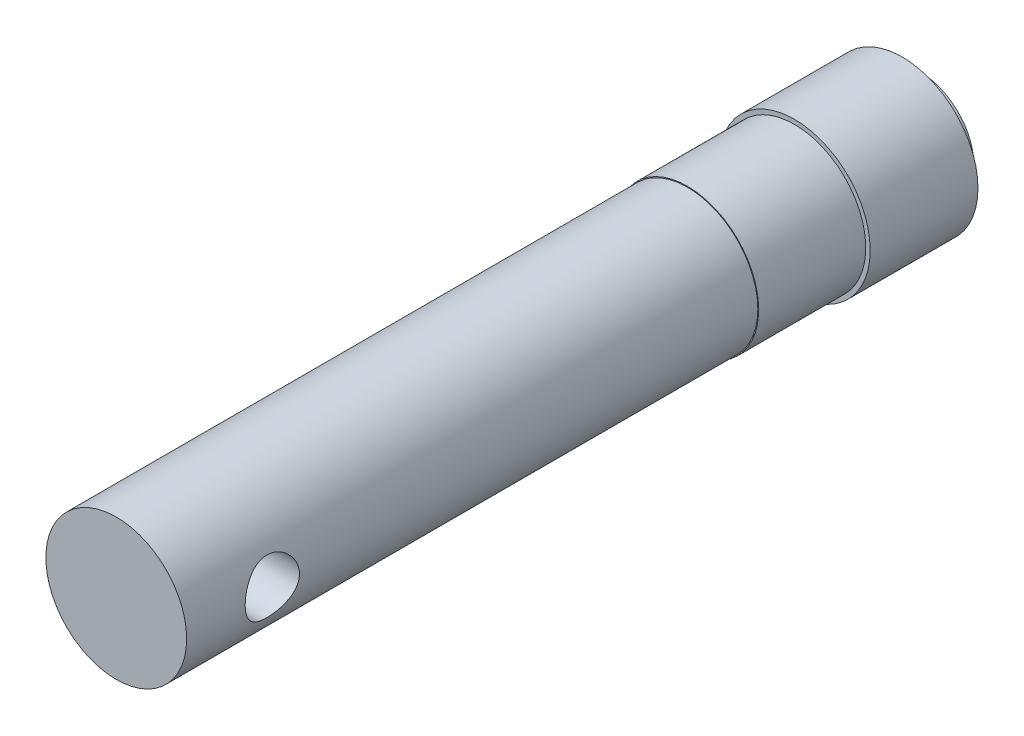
ISO-10303-21;
HEADER;
FILE_DESCRIPTION(('STEP AP214'),'2;1');
FILE_NAME('part.step','',(''),(''),'','','');
FILE_SCHEMA(('AUTOMOTIVE_DESIGN { 1 0 10303 214 1 1 1 1 }'));
ENDSEC;
DATA;
#1=APPLICATION_CONTEXT('core data for automotive mechanical design processes');
#2=APPLICATION_PROTOCOL_DEFINITION('international standard','automotive_design',2000,#1);
#3=PRODUCT_CONTEXT('',#1,'mechanical');
#4=PRODUCT('Part','Part','',(#3));
#5=PRODUCT_RELATED_PRODUCT_CATEGORY('part','',(#4));
#6=PRODUCT_DEFINITION_FORMATION('','',#4);
#7=PRODUCT_DEFINITION_CONTEXT('part definition',#1,'design');
#8=PRODUCT_DEFINITION('design','',#6,#7);
#9=PRODUCT_DEFINITION_SHAPE('','',#8);
#10=(LENGTH_UNIT() NAMED_UNIT(*) SI_UNIT(.MILLI.,.METRE.));
#11=(NAMED_UNIT(*) PLANE_ANGLE_UNIT() SI_UNIT($,.RADIAN.));
#12=(NAMED_UNIT(*) SI_UNIT($,.STERADIAN.) SOLID_ANGLE_UNIT());
#13=UNCERTAINTY_MEASURE_WITH_UNIT(LENGTH_MEASURE(1.E-05),#10,'distance_accuracy_value','');
#14=(GEOMETRIC_REPRESENTATION_CONTEXT(3) GLOBAL_UNCERTAINTY_ASSIGNED_CONTEXT((#13)) GLOBAL_UNIT_ASSIGNED_CONTEXT((#10,
#11,#12)) REPRESENTATION_CONTEXT('',''));
#15=CARTESIAN_POINT('',(0.,0.,0.));
#16=DIRECTION('',(0.,0.,1.));
#17=DIRECTION('',(1.,0.,0.));
#18=AXIS2_PLACEMENT_3D('',#15,#16,#17);
#19=CARTESIAN_POINT('',(0.,0.,28.6385));
#20=DIRECTION('',(0.,0.,1.));
#21=DIRECTION('',(1.,0.,0.));
#22=AXIS2_PLACEMENT_3D('',#19,#20,#21);
#23=PLANE('',#22);
#24=CARTESIAN_POINT('',(0.,0.,28.6385));
#25=DIRECTION('',(0.,0.,1.));
#26=DIRECTION('',(1.,0.,0.));
#27=AXIS2_PLACEMENT_3D('',#24,#25,#26);
#28=CIRCLE('',#27,12.6746);
#29=CARTESIAN_POINT('',(-12.6746,0.,28.6385));
#30=VERTEX_POINT('',#29);
#31=EDGE_CURVE('E108',#30,#30,#28,.T.);
#32=ORIENTED_EDGE('',*,*,#31,.T.);
#33=EDGE_LOOP('',(#32));
#34=FACE_BOUND('',#33,.T.);
#35=CARTESIAN_POINT('',(0.,0.,28.6385));
#36=DIRECTION('',(0.,0.,1.));
#37=DIRECTION('',(1.,0.,0.));
#38=AXIS2_PLACEMENT_3D('',#35,#36,#37);
#39=CIRCLE('',#38,12.5222);
#40=CARTESIAN_POINT('',(12.5222,0.,28.6385));
#41=VERTEX_POINT('',#40);
#42=EDGE_CURVE('E117',#41,#41,#39,.T.);
#43=ORIENTED_EDGE('',*,*,#42,.F.);
#44=EDGE_LOOP('',(#43));
#45=FACE_BOUND('',#44,.T.);
#46=ADVANCED_FACE('F32',(#34,#45),#23,.T.);
#47=CARTESIAN_POINT('',(0.,0.,9.5885));
#48=DIRECTION('',(0.,0.,1.));
#49=DIRECTION('',(1.,0.,0.));
#50=AXIS2_PLACEMENT_3D('',#47,#48,#49);
#51=PLANE('',#50);
#52=CARTESIAN_POINT('',(0.,0.,9.5885));
#53=DIRECTION('',(0.,0.,1.));
#54=DIRECTION('',(1.,0.,0.));
#55=AXIS2_PLACEMENT_3D('',#52,#53,#54);
#56=CIRCLE('',#55,13.462);
#57=CARTESIAN_POINT('',(13.462,0.,9.5885));
#58=VERTEX_POINT('',#57);
#59=EDGE_CURVE('E44',#58,#58,#56,.T.);
#60=ORIENTED_EDGE('',*,*,#59,.T.);
#61=EDGE_LOOP('',(#60));
#62=FACE_BOUND('',#61,.T.);
#63=CARTESIAN_POINT('',(0.,0.,9.5885));
#64=DIRECTION('',(0.,0.,1.));
#65=DIRECTION('',(1.,0.,0.));
#66=AXIS2_PLACEMENT_3D('',#63,#64,#65);
#67=CIRCLE('',#66,12.6746);
#68=CARTESIAN_POINT('',(-12.6746,0.,9.5885));
#69=VERTEX_POINT('',#68);
#70=EDGE_CURVE('E112',#69,#69,#67,.T.);
#71=ORIENTED_EDGE('',*,*,#70,.F.);
#72=EDGE_LOOP('',(#71));
#73=FACE_BOUND('',#72,.T.);
#74=ADVANCED_FACE('F75',(#62,#73),#51,.T.);
#75=CARTESIAN_POINT('',(0.,0.,-9.5885));
#76=DIRECTION('',(0.,0.,1.));
#77=DIRECTION('',(1.,0.,0.));
#78=AXIS2_PLACEMENT_3D('',#75,#76,#77);
#79=PLANE('',#78);
#80=CARTESIAN_POINT('',(0.,0.,-9.5885));
#81=DIRECTION('',(0.,0.,1.));
#82=DIRECTION('',(1.,0.,0.));
#83=AXIS2_PLACEMENT_3D('',#80,#81,#82);
#84=CIRCLE('',#83,13.462);
#85=CARTESIAN_POINT('',(13.462,0.,-9.5885));
#86=VERTEX_POINT('',#85);
#87=EDGE_CURVE('E49',#86,#86,#84,.T.);
#88=ORIENTED_EDGE('',*,*,#87,.F.);
#89=EDGE_LOOP('',(#88));
#90=FACE_BOUND('',#89,.T.);
#91=CARTESIAN_POINT('',(0.,0.,-9.5885));
#92=DIRECTION('',(0.,0.,1.));
#93=DIRECTION('',(1.,0.,0.));
#94=AXIS2_PLACEMENT_3D('',#91,#92,#93);
#95=CIRCLE('',#94,9.5631);
#96=CARTESIAN_POINT('',(9.5631,0.,-9.5885));
#97=VERTEX_POINT('',#96);
#98=EDGE_CURVE('E10',#97,#97,#95,.F.);
#99=ORIENTED_EDGE('',*,*,#98,.F.);
#100=EDGE_LOOP('',(#99));
#101=FACE_BOUND('',#100,.T.);
#102=ADVANCED_FACE('F80',(#90,#101),#79,.F.);
#103=CARTESIAN_POINT('',(0.,0.,9.5885));
#104=DIRECTION('',(0.,0.,-1.));
#105=DIRECTION('',(-1.,0.,0.));
#106=AXIS2_PLACEMENT_3D('',#103,#104,#105);
#107=CYLINDRICAL_SURFACE('',#106,13.462);
#108=ORIENTED_EDGE('',*,*,#59,.F.);
#109=EDGE_LOOP('',(#108));
#110=FACE_BOUND('',#109,.T.);
#111=ORIENTED_EDGE('',*,*,#87,.T.);
#112=EDGE_LOOP('',(#111));
#113=FACE_BOUND('',#112,.T.);
#114=ADVANCED_FACE('F34',(#110,#113),#107,.T.);
#115=CARTESIAN_POINT('',(0.,0.,-12.7635));
#116=DIRECTION('',(0.,0.,1.));
#117=DIRECTION('',(1.,0.,0.));
#118=AXIS2_PLACEMENT_3D('',#115,#116,#117);
#119=CYLINDRICAL_SURFACE('',#118,9.5631);
#120=CARTESIAN_POINT('',(0.,0.,-12.7635));
#121=DIRECTION('',(0.,0.,-1.));
#122=DIRECTION('',(-1.,0.,0.));
#123=AXIS2_PLACEMENT_3D('',#120,#121,#122);
#124=CIRCLE('',#123,9.5631);
#125=CARTESIAN_POINT('',(-9.5631,0.,-12.7635));
#126=VERTEX_POINT('',#125);
#127=EDGE_CURVE('E106',#126,#126,#124,.T.);
#128=ORIENTED_EDGE('',*,*,#127,.F.);
#129=EDGE_LOOP('',(#128));
#130=FACE_BOUND('',#129,.T.);
#131=ORIENTED_EDGE('',*,*,#98,.T.);
#132=EDGE_LOOP('',(#131));
#133=FACE_BOUND('',#132,.T.);
#134=ADVANCED_FACE('F91',(#130,#133),#119,.T.);
#135=CARTESIAN_POINT('',(0.,0.,-12.7635));
#136=DIRECTION('',(0.,0.,-1.));
#137=DIRECTION('',(-1.,0.,0.));
#138=AXIS2_PLACEMENT_3D('',#135,#136,#137);
#139=PLANE('',#138);
#140=ORIENTED_EDGE('',*,*,#127,.T.);
#141=EDGE_LOOP('',(#140));
#142=FACE_BOUND('',#141,.T.);
#143=ADVANCED_FACE('F87',(#142),#139,.T.);
#144=CARTESIAN_POINT('',(0.,0.,28.6385));
#145=DIRECTION('',(0.,0.,-1.));
#146=DIRECTION('',(-1.,0.,0.));
#147=AXIS2_PLACEMENT_3D('',#144,#145,#146);
#148=CYLINDRICAL_SURFACE('',#147,12.6746);
#149=CARTESIAN_POINT('',(-12.6746,0.,28.6385));
#150=CARTESIAN_POINT('',(-12.6746,0.,28.4400625));
#151=CARTESIAN_POINT('',(-12.6746,0.,28.241625));
#152=CARTESIAN_POINT('',(-12.6746,0.,27.84475));
#153=CARTESIAN_POINT('',(-12.6746,0.,27.6463125));
#154=CARTESIAN_POINT('',(-12.6746,0.,27.2494375));
#155=CARTESIAN_POINT('',(-12.6746,0.,27.051));
#156=CARTESIAN_POINT('',(-12.6746,0.,26.654125));
#157=CARTESIAN_POINT('',(-12.6746,0.,26.4556875));
#158=CARTESIAN_POINT('',(-12.6746,0.,26.0588125));
#159=CARTESIAN_POINT('',(-12.6746,0.,25.860375));
#160=CARTESIAN_POINT('',(-12.6746,0.,25.4635));
#161=CARTESIAN_POINT('',(-12.6746,0.,25.2650625));
#162=CARTESIAN_POINT('',(-12.6746,0.,24.8681875));
#163=CARTESIAN_POINT('',(-12.6746,0.,24.66975));
#164=CARTESIAN_POINT('',(-12.6746,0.,24.272875));
#165=CARTESIAN_POINT('',(-12.6746,0.,24.0744375));
#166=CARTESIAN_POINT('',(-12.6746,0.,23.6775625));
#167=CARTESIAN_POINT('',(-12.6746,0.,23.479125));
#168=CARTESIAN_POINT('',(-12.6746,0.,23.08225));
#169=CARTESIAN_POINT('',(-12.6746,0.,22.8838125));
#170=CARTESIAN_POINT('',(-12.6746,0.,22.4869375));
#171=CARTESIAN_POINT('',(-12.6746,0.,22.2885));
#172=CARTESIAN_POINT('',(-12.6746,0.,21.891625));
#173=CARTESIAN_POINT('',(-12.6746,0.,21.6931875));
#174=CARTESIAN_POINT('',(-12.6746,0.,21.2963125));
#175=CARTESIAN_POINT('',(-12.6746,0.,21.097875));
#176=CARTESIAN_POINT('',(-12.6746,0.,20.701));
#177=CARTESIAN_POINT('',(-12.6746,0.,20.5025625));
#178=CARTESIAN_POINT('',(-12.6746,0.,20.1056875));
#179=CARTESIAN_POINT('',(-12.6746,0.,19.90725));
#180=CARTESIAN_POINT('',(-12.6746,0.,19.510375));
#181=CARTESIAN_POINT('',(-12.6746,0.,19.3119375));
#182=CARTESIAN_POINT('',(-12.6746,0.,18.9150625));
#183=CARTESIAN_POINT('',(-12.6746,0.,18.716625));
#184=CARTESIAN_POINT('',(-12.6746,0.,18.31975));
#185=CARTESIAN_POINT('',(-12.6746,0.,18.1213125));
#186=CARTESIAN_POINT('',(-12.6746,0.,17.7244375));
#187=CARTESIAN_POINT('',(-12.6746,0.,17.526));
#188=CARTESIAN_POINT('',(-12.6746,0.,17.129125));
#189=CARTESIAN_POINT('',(-12.6746,0.,16.9306875));
#190=CARTESIAN_POINT('',(-12.6746,0.,16.5338125));
#191=CARTESIAN_POINT('',(-12.6746,0.,16.335375));
#192=CARTESIAN_POINT('',(-12.6746,0.,15.9385));
#193=CARTESIAN_POINT('',(-12.6746,0.,15.7400625));
#194=CARTESIAN_POINT('',(-12.6746,0.,15.3431875));
#195=CARTESIAN_POINT('',(-12.6746,0.,15.14475));
#196=CARTESIAN_POINT('',(-12.6746,0.,14.747875));
#197=CARTESIAN_POINT('',(-12.6746,0.,14.5494375));
#198=CARTESIAN_POINT('',(-12.6746,0.,14.1525625));
#199=CARTESIAN_POINT('',(-12.6746,0.,13.954125));
#200=CARTESIAN_POINT('',(-12.6746,0.,13.55725));
#201=CARTESIAN_POINT('',(-12.6746,0.,13.3588125));
#202=CARTESIAN_POINT('',(-12.6746,0.,12.9619375));
#203=CARTESIAN_POINT('',(-12.6746,0.,12.7635));
#204=CARTESIAN_POINT('',(-12.6746,0.,12.366625));
#205=CARTESIAN_POINT('',(-12.6746,0.,12.1681875));
#206=CARTESIAN_POINT('',(-12.6746,0.,11.7713125));
#207=CARTESIAN_POINT('',(-12.6746,0.,11.572875));
#208=CARTESIAN_POINT('',(-12.6746,0.,11.176));
#209=CARTESIAN_POINT('',(-12.6746,0.,10.9775625));
#210=CARTESIAN_POINT('',(-12.6746,0.,10.5806875));
#211=CARTESIAN_POINT('',(-12.6746,0.,10.38225));
#212=CARTESIAN_POINT('',(-12.6746,0.,9.985375));
#213=CARTESIAN_POINT('',(-12.6746,0.,9.7869375));
#214=CARTESIAN_POINT('',(-12.6746,0.,9.5885));
#215=B_SPLINE_CURVE_WITH_KNOTS('',3,(#149,#150,#151,#152,#153,#154,#155,#156,#157,#158,#159,
#160,#161,#162,#163,#164,#165,#166,#167,#168,#169,#170,#171,#172,#173,#174,#175,#176,#177,#178,
#179,#180,#181,#182,#183,#184,#185,#186,#187,#188,#189,#190,#191,#192,#193,#194,#195,#196,#197,
#198,#199,#200,#201,#202,#203,#204,#205,#206,#207,#208,#209,#210,#211,#212,#213,#214),
.UNSPECIFIED.,.F.,.F.,(4,2,2,2,2,2,2,2,2,2,2,2,2,2,2,2,2,2,2,2,2,2,2,2,2,2,2,2,2,2,2,2,4),(0.,
0.5953125,1.190625,1.7859375,2.38125,2.9765625,3.571875,4.1671875,4.7625,5.3578125,5.953125,
6.5484375,7.14375,7.7390625,8.334375,8.9296875,9.525,10.1203125,10.715625,11.3109375,11.90625,
12.5015625,13.096875,13.6921875,14.2875,14.8828125,15.478125,16.0734375,16.66875,17.2640625,
17.859375,18.4546875,19.05),.UNSPECIFIED.);
#216=EDGE_CURVE('BSEAM71',#30,#69,#215,.T.);
#217=ORIENTED_EDGE('',*,*,#31,.F.);
#218=ORIENTED_EDGE('',*,*,#70,.T.);
#219=ORIENTED_EDGE('',*,*,#216,.T.);
#220=ORIENTED_EDGE('',*,*,#216,.F.);
#221=EDGE_LOOP('',(#217,#219,#218,#220));
#222=FACE_BOUND('',#221,.T.);
#223=ADVANCED_FACE('F71',(#222),#148,.T.);
#224=CARTESIAN_POINT('',(0.,0.,130.2385));
#225=DIRECTION('',(0.,0.,-1.));
#226=DIRECTION('',(-1.,0.,0.));
#227=AXIS2_PLACEMENT_3D('',#224,#225,#226);
#228=CYLINDRICAL_SURFACE('',#227,12.5222);
#229=CARTESIAN_POINT('',(-12.5222,0.,119.8245));
#230=CARTESIAN_POINT('',(-12.5222005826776,-0.130385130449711,119.82450077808));
#231=CARTESIAN_POINT('',(-12.5201592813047,-0.260759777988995,119.819212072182));
#232=CARTESIAN_POINT('',(-12.5120497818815,-0.520572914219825,119.798111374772));
#233=CARTESIAN_POINT('',(-12.5059803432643,-0.650011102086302,119.782296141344));
#234=CARTESIAN_POINT('',(-12.4899810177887,-0.906872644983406,119.740312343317));
#235=CARTESIAN_POINT('',(-12.4800534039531,-1.03429714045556,119.714149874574));
#236=CARTESIAN_POINT('',(-12.456597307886,-1.28635419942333,119.651717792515));
#237=CARTESIAN_POINT('',(-12.4430674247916,-1.41098565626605,119.615444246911));
#238=CARTESIAN_POINT('',(-12.4127946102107,-1.65627598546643,119.533222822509));
#239=CARTESIAN_POINT('',(-12.396059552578,-1.77694376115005,119.487298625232));
#240=CARTESIAN_POINT('',(-12.3597808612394,-2.01387894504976,119.386117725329));
#241=CARTESIAN_POINT('',(-12.3402361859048,-2.13014470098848,119.330857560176));
#242=CARTESIAN_POINT('',(-12.2780980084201,-2.471241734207,119.151700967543));
#243=CARTESIAN_POINT('',(-12.2319764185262,-2.68855784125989,119.014365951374));
#244=CARTESIAN_POINT('',(-12.1328338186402,-3.10610150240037,118.70164586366));
#245=CARTESIAN_POINT('',(-12.0796103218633,-3.30529453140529,118.524955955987));
#246=CARTESIAN_POINT('',(-11.9731865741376,-3.67216437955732,118.141089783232));
#247=CARTESIAN_POINT('',(-11.9199863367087,-3.83983074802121,117.933903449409));
#248=CARTESIAN_POINT('',(-11.8434902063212,-4.06743386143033,117.599557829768));
#249=CARTESIAN_POINT('',(-11.818077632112,-4.1405005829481,117.481609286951));
#250=CARTESIAN_POINT('',(-11.7695913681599,-4.27637784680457,117.239505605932));
#251=CARTESIAN_POINT('',(-11.7465167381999,-4.33919251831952,117.115352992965));
#252=CARTESIAN_POINT('',(-11.7034537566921,-4.45403528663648,116.861628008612));
#253=CARTESIAN_POINT('',(-11.6834657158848,-4.50606229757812,116.732055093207));
#254=CARTESIAN_POINT('',(-11.6472743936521,-4.59880108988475,116.468469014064));
#255=CARTESIAN_POINT('',(-11.6310692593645,-4.63951841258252,116.334458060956));
#256=CARTESIAN_POINT('',(-11.6036156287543,-4.70774813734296,116.068731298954));
#257=CARTESIAN_POINT('',(-11.5921860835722,-4.73574728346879,115.937159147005));
#258=CARTESIAN_POINT('',(-11.5737277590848,-4.78068099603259,115.671888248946));
#259=CARTESIAN_POINT('',(-11.5666970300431,-4.79762046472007,115.538190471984));
#260=CARTESIAN_POINT('',(-11.5572823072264,-4.82025617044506,115.269705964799));
#261=CARTESIAN_POINT('',(-11.5548975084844,-4.82595435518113,115.134919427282));
#262=CARTESIAN_POINT('',(-11.5548596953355,-4.82604509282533,114.865344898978));
#263=CARTESIAN_POINT('',(-11.5572064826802,-4.8204381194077,114.730556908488));
#264=CARTESIAN_POINT('',(-11.5662451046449,-4.79870733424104,114.470692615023));
#265=CARTESIAN_POINT('',(-11.5726489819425,-4.78328019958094,114.345547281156));
#266=CARTESIAN_POINT('',(-11.5893243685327,-4.74273480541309,114.097058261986));
#267=CARTESIAN_POINT('',(-11.5995971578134,-4.71761333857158,113.973715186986));
#268=CARTESIAN_POINT('',(-11.6236949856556,-4.6579225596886,113.729721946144));
#269=CARTESIAN_POINT('',(-11.6375191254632,-4.62335563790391,113.609071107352));
#270=CARTESIAN_POINT('',(-11.6683109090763,-4.54508249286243,113.371168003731));
#271=CARTESIAN_POINT('',(-11.6852797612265,-4.50137275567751,113.253917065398));
#272=CARTESIAN_POINT('',(-11.7409096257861,-4.35518008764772,112.903910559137));
#273=CARTESIAN_POINT('',(-11.7838169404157,-4.23875508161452,112.677471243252));
#274=CARTESIAN_POINT('',(-11.8761636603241,-3.97265705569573,112.246677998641));
#275=CARTESIAN_POINT('',(-11.9256054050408,-3.82297211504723,112.042332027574));
#276=CARTESIAN_POINT('',(-12.0297610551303,-3.48199409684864,111.646032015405));
#277=CARTESIAN_POINT('',(-12.0845995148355,-3.28849526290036,111.456000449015));
#278=CARTESIAN_POINT('',(-12.1903491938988,-2.87176743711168,111.110503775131));
#279=CARTESIAN_POINT('',(-12.241259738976,-2.64853335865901,110.955044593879));
#280=CARTESIAN_POINT('',(-12.3345343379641,-2.17353370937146,110.680807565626));
#281=CARTESIAN_POINT('',(-12.3767368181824,-1.92134442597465,110.562704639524));
#282=CARTESIAN_POINT('',(-12.4466323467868,-1.39864274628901,110.371250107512));
#283=CARTESIAN_POINT('',(-12.4743322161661,-1.12813903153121,110.297877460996));
#284=CARTESIAN_POINT('',(-12.5108844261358,-0.592661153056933,110.201744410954));
#285=CARTESIAN_POINT('',(-12.5207000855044,-0.328217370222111,110.176394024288));
#286=CARTESIAN_POINT('',(-12.5233783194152,0.201299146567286,110.169440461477));
#287=CARTESIAN_POINT('',(-12.5162449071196,0.466371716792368,110.187826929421));
#288=CARTESIAN_POINT('',(-12.4864604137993,0.978206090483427,110.265881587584));
#289=CARTESIAN_POINT('',(-12.4644583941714,1.22527286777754,110.323824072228));
#290=CARTESIAN_POINT('',(-12.4078095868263,1.70598230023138,110.477043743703));
#291=CARTESIAN_POINT('',(-12.3731611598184,1.93962321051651,110.57232577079));
#292=CARTESIAN_POINT('',(-12.2933271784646,2.39470181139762,110.800592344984));
#293=CARTESIAN_POINT('',(-12.2478571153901,2.61556443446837,110.934620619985));
#294=CARTESIAN_POINT('',(-12.1513681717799,3.03242430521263,111.235417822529));
#295=CARTESIAN_POINT('',(-12.1003471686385,3.22841197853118,111.402199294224));
#296=CARTESIAN_POINT('',(-11.9944739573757,3.6025252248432,111.775735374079));
#297=CARTESIAN_POINT('',(-11.9395786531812,3.778818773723,111.984313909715));
#298=CARTESIAN_POINT('',(-11.8350957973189,4.09435251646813,112.429293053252));
#299=CARTESIAN_POINT('',(-11.7855088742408,4.23358832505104,112.665696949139));
#300=CARTESIAN_POINT('',(-11.7194948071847,4.41168463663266,113.037268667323));
#301=CARTESIAN_POINT('',(-11.6988237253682,4.46606731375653,113.16445606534));
#302=CARTESIAN_POINT('',(-11.6610264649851,4.56384799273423,113.423477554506));
#303=CARTESIAN_POINT('',(-11.6438987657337,4.60725070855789,113.555309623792));
#304=CARTESIAN_POINT('',(-11.6137971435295,4.6826121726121,113.822615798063));
#305=CARTESIAN_POINT('',(-11.6008218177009,4.71457478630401,113.958088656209));
#306=CARTESIAN_POINT('',(-11.5794950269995,4.76671638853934,114.231642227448));
#307=CARTESIAN_POINT('',(-11.5711432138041,4.7868962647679,114.369722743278));
#308=CARTESIAN_POINT('',(-11.5597800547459,4.81426833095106,114.637918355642));
#309=CARTESIAN_POINT('',(-11.5564455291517,4.82224707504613,114.767940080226));
#310=CARTESIAN_POINT('',(-11.5541835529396,4.82766457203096,115.028288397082));
#311=CARTESIAN_POINT('',(-11.5552575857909,4.82509977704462,115.158615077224));
#312=CARTESIAN_POINT('',(-11.5617784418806,4.8094534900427,115.418460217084));
#313=CARTESIAN_POINT('',(-11.5672231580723,4.79637706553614,115.547979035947));
#314=CARTESIAN_POINT('',(-11.5823012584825,4.75985078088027,115.805344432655));
#315=CARTESIAN_POINT('',(-11.5919362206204,4.73639701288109,115.93319036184));
#316=CARTESIAN_POINT('',(-11.6146800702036,4.68033983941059,116.18187276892));
#317=CARTESIAN_POINT('',(-11.6276575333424,4.64808028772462,116.302798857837));
#318=CARTESIAN_POINT('',(-11.65683655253,4.5744088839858,116.541444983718));
#319=CARTESIAN_POINT('',(-11.6730392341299,4.53299383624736,116.659163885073));
#320=CARTESIAN_POINT('',(-11.7258138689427,4.39550568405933,117.006401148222));
#321=CARTESIAN_POINT('',(-11.7665702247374,4.28614788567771,117.230183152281));
#322=CARTESIAN_POINT('',(-11.8573680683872,4.02839105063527,117.668830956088));
#323=CARTESIAN_POINT('',(-11.9077944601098,3.87818953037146,117.882546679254));
#324=CARTESIAN_POINT('',(-12.0110271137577,3.54555250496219,118.282853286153));
#325=CARTESIAN_POINT('',(-12.0638341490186,3.36310646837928,118.469435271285));
#326=CARTESIAN_POINT('',(-12.1423424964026,3.06277900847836,118.730618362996));
#327=CARTESIAN_POINT('',(-12.1691137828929,2.95487657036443,118.816621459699));
#328=CARTESIAN_POINT('',(-12.2211069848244,2.73187138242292,118.979224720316));
#329=CARTESIAN_POINT('',(-12.2463294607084,2.61677126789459,119.055828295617));
#330=CARTESIAN_POINT('',(-12.2945391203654,2.38000175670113,119.199099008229));
#331=CARTESIAN_POINT('',(-12.3175248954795,2.25832829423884,119.265759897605));
#332=CARTESIAN_POINT('',(-12.3605850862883,2.00932435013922,119.388505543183));
#333=CARTESIAN_POINT('',(-12.380660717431,1.88199625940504,119.444594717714));
#334=CARTESIAN_POINT('',(-12.4185730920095,1.61372277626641,119.549134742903));
#335=CARTESIAN_POINT('',(-12.4361658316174,1.47243938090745,119.596810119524));
#336=CARTESIAN_POINT('',(-12.4667745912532,1.18566702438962,119.678959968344));
#337=CARTESIAN_POINT('',(-12.4797926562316,1.04017997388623,119.71344033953));
#338=CARTESIAN_POINT('',(-12.5008081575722,0.746312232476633,119.76878762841));
#339=CARTESIAN_POINT('',(-12.5088067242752,0.59793220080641,119.789657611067));
#340=CARTESIAN_POINT('',(-12.5195019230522,0.299696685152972,119.817512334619));
#341=CARTESIAN_POINT('',(-12.5221993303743,0.149841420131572,119.824499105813));
#342=CARTESIAN_POINT('',(-12.5222,0.,119.8245));
#343=B_SPLINE_CURVE_WITH_KNOTS('',3,(#229,#230,#231,#232,#233,#234,#235,#236,#237,#238,#239,
#240,#241,#242,#243,#244,#245,#246,#247,#248,#249,#250,#251,#252,#253,#254,#255,#256,#257,#258,
#259,#260,#261,#262,#263,#264,#265,#266,#267,#268,#269,#270,#271,#272,#273,#274,#275,#276,#277,
#278,#279,#280,#281,#282,#283,#284,#285,#286,#287,#288,#289,#290,#291,#292,#293,#294,#295,#296,
#297,#298,#299,#300,#301,#302,#303,#304,#305,#306,#307,#308,#309,#310,#311,#312,#313,#314,#315,
#316,#317,#318,#319,#320,#321,#322,#323,#324,#325,#326,#327,#328,#329,#330,#331,#332,#333,#334,
#335,#336,#337,#338,#339,#340,#341,#342),.UNSPECIFIED.,.T.,.F.,(4,2,2,2,2,2,2,2,2,2,2,2,2,2,2,2,
2,2,2,2,2,2,2,2,2,2,2,2,2,2,2,2,2,2,2,2,2,2,2,2,2,2,2,2,2,2,2,2,2,2,2,2,2,2,2,2,4),(0.,
0.391014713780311,0.782149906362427,1.17305501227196,1.56411235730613,1.95422107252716,
2.34447479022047,3.12439881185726,3.93559389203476,4.74705740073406,5.16978427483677,
5.59234046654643,6.01493917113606,6.43733045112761,6.84180994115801,7.24611002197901,
7.65034004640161,8.05455313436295,8.43287380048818,8.8113197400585,9.18966999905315,
9.56816594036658,10.3391815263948,11.1104739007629,11.936761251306,12.7631901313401,
13.6037944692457,14.444003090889,15.2374414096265,16.0306918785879,16.7913774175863,
17.5521615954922,18.3357313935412,19.1196018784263,19.9515351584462,20.7835668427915,
21.2026963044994,21.6216455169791,22.0404530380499,22.4592290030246,22.8496628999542,
23.2402281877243,23.6306053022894,24.0211295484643,24.3981707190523,24.7753437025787,
25.5291303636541,26.3239860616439,27.1191018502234,27.540349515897,27.9614438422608,
28.3828016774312,28.8039830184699,29.2537138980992,29.7032434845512,30.1526718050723,
30.6020343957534),.UNSPECIFIED.);
#344=CARTESIAN_POINT('',(-12.5222,0.,119.8245));
#345=VERTEX_POINT('',#344);
#346=EDGE_CURVE('E36',#345,#345,#343,.T.);
#347=ORIENTED_EDGE('',*,*,#346,.T.);
#348=EDGE_LOOP('',(#347));
#349=FACE_BOUND('',#348,.T.);
#350=CARTESIAN_POINT('',(12.5222,0.,110.1725));
#351=CARTESIAN_POINT('',(12.5222005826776,-0.130385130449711,110.17249922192));
#352=CARTESIAN_POINT('',(12.5201592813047,-0.260759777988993,110.177787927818));
#353=CARTESIAN_POINT('',(12.5120497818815,-0.520572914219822,110.198888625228));
#354=CARTESIAN_POINT('',(12.5059803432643,-0.6500111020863,110.214703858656));
#355=CARTESIAN_POINT('',(12.4899810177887,-0.906872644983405,110.256687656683));
#356=CARTESIAN_POINT('',(12.4800534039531,-1.03429714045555,110.282850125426));
#357=CARTESIAN_POINT('',(12.456597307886,-1.28635419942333,110.345282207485));
#358=CARTESIAN_POINT('',(12.4430674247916,-1.41098565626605,110.381555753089));
#359=CARTESIAN_POINT('',(12.4127946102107,-1.65627598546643,110.463777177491));
#360=CARTESIAN_POINT('',(12.396059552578,-1.77694376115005,110.509701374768));
#361=CARTESIAN_POINT('',(12.3597808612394,-2.01387894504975,110.610882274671));
#362=CARTESIAN_POINT('',(12.3402361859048,-2.13014470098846,110.666142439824));
#363=CARTESIAN_POINT('',(12.2780980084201,-2.47124173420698,110.845299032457));
#364=CARTESIAN_POINT('',(12.2319764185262,-2.68855784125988,110.982634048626));
#365=CARTESIAN_POINT('',(12.1328338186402,-3.10610150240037,111.29535413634));
#366=CARTESIAN_POINT('',(12.0796103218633,-3.30529453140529,111.472044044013));
#367=CARTESIAN_POINT('',(11.9731865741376,-3.67216437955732,111.855910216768));
#368=CARTESIAN_POINT('',(11.9199863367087,-3.83983074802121,112.063096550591));
#369=CARTESIAN_POINT('',(11.8434902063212,-4.06743386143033,112.397442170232));
#370=CARTESIAN_POINT('',(11.818077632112,-4.1405005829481,112.515390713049));
#371=CARTESIAN_POINT('',(11.7695913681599,-4.27637784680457,112.757494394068));
#372=CARTESIAN_POINT('',(11.7465167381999,-4.33919251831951,112.881647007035));
#373=CARTESIAN_POINT('',(11.7034537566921,-4.45403528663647,113.135371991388));
#374=CARTESIAN_POINT('',(11.6834657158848,-4.5060622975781,113.264944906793));
#375=CARTESIAN_POINT('',(11.6472743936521,-4.59880108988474,113.528530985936));
#376=CARTESIAN_POINT('',(11.6310692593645,-4.63951841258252,113.662541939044));
#377=CARTESIAN_POINT('',(11.6036156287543,-4.70774813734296,113.928268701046));
#378=CARTESIAN_POINT('',(11.5921860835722,-4.73574728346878,114.059840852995));
#379=CARTESIAN_POINT('',(11.5737277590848,-4.78068099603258,114.325111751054));
#380=CARTESIAN_POINT('',(11.5666970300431,-4.79762046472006,114.458809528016));
#381=CARTESIAN_POINT('',(11.5572823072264,-4.82025617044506,114.727294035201));
#382=CARTESIAN_POINT('',(11.5548975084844,-4.82595435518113,114.862080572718));
#383=CARTESIAN_POINT('',(11.5548596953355,-4.82604509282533,115.131655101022));
#384=CARTESIAN_POINT('',(11.5572064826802,-4.8204381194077,115.266443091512));
#385=CARTESIAN_POINT('',(11.5662451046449,-4.79870733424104,115.526307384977));
#386=CARTESIAN_POINT('',(11.5726489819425,-4.78328019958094,115.651452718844));
#387=CARTESIAN_POINT('',(11.5893243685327,-4.74273480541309,115.899941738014));
#388=CARTESIAN_POINT('',(11.5995971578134,-4.71761333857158,116.023284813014));
#389=CARTESIAN_POINT('',(11.6236949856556,-4.6579225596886,116.267278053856));
#390=CARTESIAN_POINT('',(11.6375191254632,-4.62335563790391,116.387928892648));
#391=CARTESIAN_POINT('',(11.6683109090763,-4.54508249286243,116.625831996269));
#392=CARTESIAN_POINT('',(11.6852797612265,-4.50137275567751,116.743082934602));
#393=CARTESIAN_POINT('',(11.7409096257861,-4.35518008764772,117.093089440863));
#394=CARTESIAN_POINT('',(11.7838169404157,-4.23875508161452,117.319528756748));
#395=CARTESIAN_POINT('',(11.8761636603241,-3.97265705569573,117.750322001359));
#396=CARTESIAN_POINT('',(11.9256054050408,-3.82297211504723,117.954667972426));
#397=CARTESIAN_POINT('',(12.0297610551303,-3.48199409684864,118.350967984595));
#398=CARTESIAN_POINT('',(12.0845995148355,-3.28849526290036,118.540999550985));
#399=CARTESIAN_POINT('',(12.1903491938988,-2.87176743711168,118.886496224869));
#400=CARTESIAN_POINT('',(12.241259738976,-2.64853335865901,119.041955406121));
#401=CARTESIAN_POINT('',(12.3345343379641,-2.17353370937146,119.316192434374));
#402=CARTESIAN_POINT('',(12.3767368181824,-1.92134442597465,119.434295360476));
#403=CARTESIAN_POINT('',(12.4466323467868,-1.39864274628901,119.625749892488));
#404=CARTESIAN_POINT('',(12.4743322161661,-1.12813903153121,119.699122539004));
#405=CARTESIAN_POINT('',(12.5108844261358,-0.592661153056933,119.795255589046));
#406=CARTESIAN_POINT('',(12.5207000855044,-0.328217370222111,119.820605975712));
#407=CARTESIAN_POINT('',(12.5233783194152,0.201299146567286,119.827559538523));
#408=CARTESIAN_POINT('',(12.5162449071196,0.466371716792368,119.809173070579));
#409=CARTESIAN_POINT('',(12.4864604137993,0.978206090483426,119.731118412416));
#410=CARTESIAN_POINT('',(12.4644583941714,1.22527286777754,119.673175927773));
#411=CARTESIAN_POINT('',(12.4078095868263,1.70598230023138,119.519956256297));
#412=CARTESIAN_POINT('',(12.3731611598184,1.9396232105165,119.42467422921));
#413=CARTESIAN_POINT('',(12.2933271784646,2.39470181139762,119.196407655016));
#414=CARTESIAN_POINT('',(12.2478571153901,2.61556443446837,119.062379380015));
#415=CARTESIAN_POINT('',(12.1513681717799,3.03242430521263,118.761582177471));
#416=CARTESIAN_POINT('',(12.1003471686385,3.22841197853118,118.594800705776));
#417=CARTESIAN_POINT('',(11.9944739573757,3.6025252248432,118.221264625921));
#418=CARTESIAN_POINT('',(11.9395786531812,3.778818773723,118.012686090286));
#419=CARTESIAN_POINT('',(11.8350957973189,4.09435251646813,117.567706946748));
#420=CARTESIAN_POINT('',(11.7855088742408,4.23358832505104,117.331303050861));
#421=CARTESIAN_POINT('',(11.7194948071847,4.41168463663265,116.959731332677));
#422=CARTESIAN_POINT('',(11.6988237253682,4.46606731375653,116.83254393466));
#423=CARTESIAN_POINT('',(11.6610264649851,4.56384799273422,116.573522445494));
#424=CARTESIAN_POINT('',(11.6438987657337,4.60725070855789,116.441690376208));
#425=CARTESIAN_POINT('',(11.6137971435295,4.68261217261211,116.174384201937));
#426=CARTESIAN_POINT('',(11.6008218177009,4.71457478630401,116.038911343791));
#427=CARTESIAN_POINT('',(11.5794950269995,4.76671638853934,115.765357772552));
#428=CARTESIAN_POINT('',(11.5711432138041,4.7868962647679,115.627277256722));
#429=CARTESIAN_POINT('',(11.5597800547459,4.81426833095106,115.359081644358));
#430=CARTESIAN_POINT('',(11.5564455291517,4.82224707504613,115.229059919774));
#431=CARTESIAN_POINT('',(11.5541835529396,4.82766457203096,114.968711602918));
#432=CARTESIAN_POINT('',(11.5552575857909,4.82509977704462,114.838384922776));
#433=CARTESIAN_POINT('',(11.5617784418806,4.8094534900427,114.578539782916));
#434=CARTESIAN_POINT('',(11.5672231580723,4.79637706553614,114.449020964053));
#435=CARTESIAN_POINT('',(11.5823012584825,4.75985078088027,114.191655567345));
#436=CARTESIAN_POINT('',(11.5919362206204,4.73639701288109,114.06380963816));
#437=CARTESIAN_POINT('',(11.6146800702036,4.68033983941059,113.81512723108));
#438=CARTESIAN_POINT('',(11.6276575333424,4.64808028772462,113.694201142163));
#439=CARTESIAN_POINT('',(11.65683655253,4.57440888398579,113.455555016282));
#440=CARTESIAN_POINT('',(11.6730392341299,4.53299383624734,113.337836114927));
#441=CARTESIAN_POINT('',(11.7258138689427,4.39550568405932,112.990598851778));
#442=CARTESIAN_POINT('',(11.7665702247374,4.28614788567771,112.766816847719));
#443=CARTESIAN_POINT('',(11.8573680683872,4.02839105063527,112.328169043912));
#444=CARTESIAN_POINT('',(11.9077944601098,3.87818953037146,112.114453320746));
#445=CARTESIAN_POINT('',(12.0110271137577,3.54555250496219,111.714146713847));
#446=CARTESIAN_POINT('',(12.0638341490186,3.36310646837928,111.527564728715));
#447=CARTESIAN_POINT('',(12.1423424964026,3.06277900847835,111.266381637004));
#448=CARTESIAN_POINT('',(12.1691137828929,2.95487657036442,111.180378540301));
#449=CARTESIAN_POINT('',(12.2211069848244,2.73187138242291,111.017775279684));
#450=CARTESIAN_POINT('',(12.2463294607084,2.61677126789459,110.941171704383));
#451=CARTESIAN_POINT('',(12.2945391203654,2.38000175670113,110.797900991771));
#452=CARTESIAN_POINT('',(12.3175248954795,2.25832829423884,110.731240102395));
#453=CARTESIAN_POINT('',(12.3605850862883,2.00932435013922,110.608494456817));
#454=CARTESIAN_POINT('',(12.380660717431,1.88199625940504,110.552405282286));
#455=CARTESIAN_POINT('',(12.4185730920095,1.61372277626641,110.447865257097));
#456=CARTESIAN_POINT('',(12.4361658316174,1.47243938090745,110.400189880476));
#457=CARTESIAN_POINT('',(12.4667745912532,1.18566702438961,110.318040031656));
#458=CARTESIAN_POINT('',(12.4797926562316,1.04017997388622,110.28355966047));
#459=CARTESIAN_POINT('',(12.5008081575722,0.74631223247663,110.22821237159));
#460=CARTESIAN_POINT('',(12.5088067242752,0.597932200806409,110.207342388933));
#461=CARTESIAN_POINT('',(12.5195019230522,0.299696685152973,110.179487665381));
#462=CARTESIAN_POINT('',(12.5221993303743,0.149841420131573,110.172500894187));
#463=CARTESIAN_POINT('',(12.5222,0.,110.1725));
#464=B_SPLINE_CURVE_WITH_KNOTS('',3,(#350,#351,#352,#353,#354,#355,#356,#357,#358,#359,#360,
#361,#362,#363,#364,#365,#366,#367,#368,#369,#370,#371,#372,#373,#374,#375,#376,#377,#378,#379,
#380,#381,#382,#383,#384,#385,#386,#387,#388,#389,#390,#391,#392,#393,#394,#395,#396,#397,#398,
#399,#400,#401,#402,#403,#404,#405,#406,#407,#408,#409,#410,#411,#412,#413,#414,#415,#416,#417,
#418,#419,#420,#421,#422,#423,#424,#425,#426,#427,#428,#429,#430,#431,#432,#433,#434,#435,#436,
#437,#438,#439,#440,#441,#442,#443,#444,#445,#446,#447,#448,#449,#450,#451,#452,#453,#454,#455,
#456,#457,#458,#459,#460,#461,#462,#463),.UNSPECIFIED.,.T.,.F.,(4,2,2,2,2,2,2,2,2,2,2,2,2,2,2,2,
2,2,2,2,2,2,2,2,2,2,2,2,2,2,2,2,2,2,2,2,2,2,2,2,2,2,2,2,2,2,2,2,2,2,2,2,2,2,2,2,4),(0.,
0.391014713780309,0.782149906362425,1.17305501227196,1.56411235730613,1.95422107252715,
2.34447479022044,3.12439881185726,3.93559389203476,4.74705740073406,5.16978427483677,
5.59234046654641,6.01493917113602,6.43733045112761,6.84180994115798,7.24611002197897,
7.65034004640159,8.05455313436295,8.43287380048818,8.8113197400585,9.18966999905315,
9.56816594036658,10.3391815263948,11.1104739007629,11.936761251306,12.7631901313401,
13.6037944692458,14.444003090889,15.2374414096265,16.0306918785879,16.7913774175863,
17.5521615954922,18.3357313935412,19.1196018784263,19.9515351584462,20.7835668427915,
21.2026963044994,21.6216455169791,22.04045303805,22.4592290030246,22.8496628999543,
23.2402281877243,23.6306053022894,24.0211295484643,24.3981707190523,24.7753437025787,
25.5291303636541,26.3239860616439,27.1191018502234,27.540349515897,27.9614438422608,
28.3828016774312,28.80398301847,29.2537138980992,29.7032434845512,30.1526718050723,
30.6020343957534),.UNSPECIFIED.);
#465=CARTESIAN_POINT('',(12.5222,0.,110.1725));
#466=VERTEX_POINT('',#465);
#467=EDGE_CURVE('E52',#466,#466,#464,.T.);
#468=ORIENTED_EDGE('',*,*,#467,.T.);
#469=EDGE_LOOP('',(#468));
#470=FACE_BOUND('',#469,.T.);
#471=CARTESIAN_POINT('',(0.,0.,130.2385));
#472=DIRECTION('',(0.,0.,1.));
#473=DIRECTION('',(1.,0.,0.));
#474=AXIS2_PLACEMENT_3D('',#471,#472,#473);
#475=CIRCLE('',#474,12.5222);
#476=CARTESIAN_POINT('',(12.5222,0.,130.2385));
#477=VERTEX_POINT('',#476);
#478=EDGE_CURVE('E115',#477,#477,#475,.T.);
#479=ORIENTED_EDGE('',*,*,#478,.F.);
#480=EDGE_LOOP('',(#479));
#481=FACE_BOUND('',#480,.T.);
#482=ORIENTED_EDGE('',*,*,#42,.T.);
#483=EDGE_LOOP('',(#482));
#484=FACE_BOUND('',#483,.T.);
#485=ADVANCED_FACE('F56',(#349,#470,#481,#484),#228,.T.);
#486=CARTESIAN_POINT('',(0.,0.,130.2385));
#487=DIRECTION('',(0.,0.,1.));
#488=DIRECTION('',(1.,0.,0.));
#489=AXIS2_PLACEMENT_3D('',#486,#487,#488);
#490=PLANE('',#489);
#491=ORIENTED_EDGE('',*,*,#478,.T.);
#492=EDGE_LOOP('',(#491));
#493=FACE_BOUND('',#492,.T.);
#494=ADVANCED_FACE('F63',(#493),#490,.T.);
#495=CARTESIAN_POINT('',(-13.462,0.,114.9985));
#496=DIRECTION('',(1.,0.,0.));
#497=DIRECTION('',(0.,0.,-1.));
#498=AXIS2_PLACEMENT_3D('',#495,#496,#497);
#499=CYLINDRICAL_SURFACE('',#498,4.82599999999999);
#500=ORIENTED_EDGE('',*,*,#467,.F.);
#501=EDGE_LOOP('',(#500));
#502=FACE_BOUND('',#501,.T.);
#503=ORIENTED_EDGE('',*,*,#346,.F.);
#504=EDGE_LOOP('',(#503));
#505=FACE_BOUND('',#504,.T.);
#506=ADVANCED_FACE('F60',(#502,#505),#499,.F.);
#507=CLOSED_SHELL('',(#46,#74,#102,#114,#134,#143,#223,#485,#494,#506));
#508=MANIFOLD_SOLID_BREP('B2',#507);
#509=ADVANCED_BREP_SHAPE_REPRESENTATION('',(#18,#508),#14);
#510=SHAPE_DEFINITION_REPRESENTATION(#9,#509);
ENDSEC;
END-ISO-10303-21;
